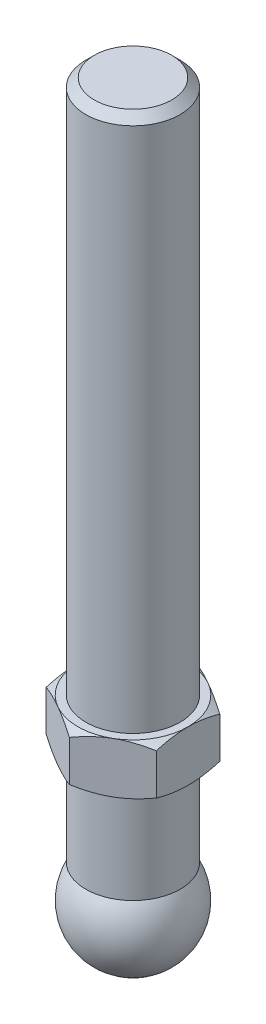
ISO-10303-21;
HEADER;
FILE_DESCRIPTION(('STEP AP214'),'2;1');
FILE_NAME('part.step','',(''),(''),'','','');
FILE_SCHEMA(('AUTOMOTIVE_DESIGN { 1 0 10303 214 1 1 1 1 }'));
ENDSEC;
DATA;
#1=APPLICATION_CONTEXT('core data for automotive mechanical design processes');
#2=APPLICATION_PROTOCOL_DEFINITION('international standard','automotive_design',2000,#1);
#3=PRODUCT_CONTEXT('',#1,'mechanical');
#4=PRODUCT('Part','Part','',(#3));
#5=PRODUCT_RELATED_PRODUCT_CATEGORY('part','',(#4));
#6=PRODUCT_DEFINITION_FORMATION('','',#4);
#7=PRODUCT_DEFINITION_CONTEXT('part definition',#1,'design');
#8=PRODUCT_DEFINITION('design','',#6,#7);
#9=PRODUCT_DEFINITION_SHAPE('','',#8);
#10=(LENGTH_UNIT() NAMED_UNIT(*) SI_UNIT(.MILLI.,.METRE.));
#11=(NAMED_UNIT(*) PLANE_ANGLE_UNIT() SI_UNIT($,.RADIAN.));
#12=(NAMED_UNIT(*) SI_UNIT($,.STERADIAN.) SOLID_ANGLE_UNIT());
#13=UNCERTAINTY_MEASURE_WITH_UNIT(LENGTH_MEASURE(1.E-05),#10,'distance_accuracy_value','');
#14=(GEOMETRIC_REPRESENTATION_CONTEXT(3) GLOBAL_UNCERTAINTY_ASSIGNED_CONTEXT((#13)) GLOBAL_UNIT_ASSIGNED_CONTEXT((#10,
#11,#12)) REPRESENTATION_CONTEXT('',''));
#15=CARTESIAN_POINT('',(0.,0.,0.));
#16=DIRECTION('',(0.,0.,1.));
#17=DIRECTION('',(1.,0.,0.));
#18=AXIS2_PLACEMENT_3D('',#15,#16,#17);
#19=CARTESIAN_POINT('',(0.,22.6,0.));
#20=DIRECTION('',(0.,-1.,0.));
#21=DIRECTION('',(0.,0.,-1.));
#22=AXIS2_PLACEMENT_3D('',#19,#20,#21);
#23=CONICAL_SURFACE('',#22,7.,1.0471975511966);
#24=CARTESIAN_POINT('',(-7.,18.5382826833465,12.1648696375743));
#25=CARTESIAN_POINT('',(-7.,18.683915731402,11.8738003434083));
#26=CARTESIAN_POINT('',(-7.,18.82854589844,11.5822239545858));
#27=CARTESIAN_POINT('',(-7.,19.1153156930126,10.997825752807));
#28=CARTESIAN_POINT('',(-7.,19.2574551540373,10.7050038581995));
#29=CARTESIAN_POINT('',(-7.,19.5390221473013,10.1173316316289));
#30=CARTESIAN_POINT('',(-7.,19.6784436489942,9.82247840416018));
#31=CARTESIAN_POINT('',(-7.,19.9536060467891,9.2310632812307));
#32=CARTESIAN_POINT('',(-7.,20.0893470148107,8.93450141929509));
#33=CARTESIAN_POINT('',(-7.,20.3623110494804,8.32593520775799));
#34=CARTESIAN_POINT('',(-7.,20.4993254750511,8.01383696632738));
#35=CARTESIAN_POINT('',(-7.,20.7671383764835,7.3869579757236));
#36=CARTESIAN_POINT('',(-7.,20.8979365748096,7.07217710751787));
#37=CARTESIAN_POINT('',(-7.,21.1515530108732,6.43962449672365));
#38=CARTESIAN_POINT('',(-7.,21.274376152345,6.12185473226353));
#39=CARTESIAN_POINT('',(-7.,21.5099016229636,5.48260317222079));
#40=CARTESIAN_POINT('',(-7.,21.6226050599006,5.16112178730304));
#41=CARTESIAN_POINT('',(-7.,21.8599014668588,4.43821731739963));
#42=CARTESIAN_POINT('',(-7.,21.981118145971,4.03566892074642));
#43=CARTESIAN_POINT('',(-7.,22.1969740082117,3.22331060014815));
#44=CARTESIAN_POINT('',(-7.,22.2916155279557,2.81350131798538));
#45=CARTESIAN_POINT('',(-7.,22.4069999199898,2.19742561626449));
#46=CARTESIAN_POINT('',(-7.,22.4408518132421,1.99359214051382));
#47=CARTESIAN_POINT('',(-7.,22.4993191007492,1.5846161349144));
#48=CARTESIAN_POINT('',(-7.,22.5239358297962,1.37947379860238));
#49=CARTESIAN_POINT('',(-7.,22.5631968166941,0.968289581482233));
#50=CARTESIAN_POINT('',(-7.,22.5778439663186,0.762247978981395));
#51=CARTESIAN_POINT('',(-7.,22.5967021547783,0.349683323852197));
#52=CARTESIAN_POINT('',(-7.,22.6009132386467,0.143160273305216));
#53=CARTESIAN_POINT('',(-7.,22.5987493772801,-0.271082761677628));
#54=CARTESIAN_POINT('',(-7.,22.5923100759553,-0.478802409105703));
#55=CARTESIAN_POINT('',(-7.,22.5689433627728,-0.893645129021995));
#56=CARTESIAN_POINT('',(-7.,22.5520159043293,-1.10076819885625));
#57=CARTESIAN_POINT('',(-7.,22.5082124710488,-1.51403043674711));
#58=CARTESIAN_POINT('',(-7.,22.4813327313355,-1.72016920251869));
#59=CARTESIAN_POINT('',(-7.,22.4184180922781,-2.13103319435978));
#60=CARTESIAN_POINT('',(-7.,22.3823828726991,-2.33575837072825));
#61=CARTESIAN_POINT('',(-7.,22.2605686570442,-2.95437912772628));
#62=CARTESIAN_POINT('',(-7.,22.1618729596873,-3.36575077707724));
#63=CARTESIAN_POINT('',(-7.,21.9384533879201,-4.1813801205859));
#64=CARTESIAN_POINT('',(-7.,21.8137148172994,-4.58563365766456));
#65=CARTESIAN_POINT('',(-7.,21.5733248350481,-5.30320893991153));
#66=CARTESIAN_POINT('',(-7.,21.4612875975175,-5.6177595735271));
#67=CARTESIAN_POINT('',(-7.,21.2278514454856,-6.24325021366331));
#68=CARTESIAN_POINT('',(-7.,21.1064551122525,-6.55419118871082));
#69=CARTESIAN_POINT('',(-7.,20.8562070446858,-7.17328528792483));
#70=CARTESIAN_POINT('',(-7.,20.7273503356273,-7.48143638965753));
#71=CARTESIAN_POINT('',(-7.,20.4637823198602,-8.09523802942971));
#72=CARTESIAN_POINT('',(-7.,20.3290706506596,-8.40088841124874));
#73=CARTESIAN_POINT('',(-7.,20.0607840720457,-8.99716345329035));
#74=CARTESIAN_POINT('',(-7.,19.9274031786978,-9.2878756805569));
#75=CARTESIAN_POINT('',(-7.,19.6571471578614,-9.86766295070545));
#76=CARTESIAN_POINT('',(-7.,19.52027208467,-10.1567380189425));
#77=CARTESIAN_POINT('',(-7.,19.2438978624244,-10.7329937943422));
#78=CARTESIAN_POINT('',(-7.,19.1044038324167,-11.0201769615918));
#79=CARTESIAN_POINT('',(-7.,18.8230228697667,-11.5933594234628));
#80=CARTESIAN_POINT('',(-7.,18.6811360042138,-11.879358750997));
#81=CARTESIAN_POINT('',(-7.,18.5382826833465,-12.1648696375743));
#82=B_SPLINE_CURVE_WITH_KNOTS('',3,(#24,#25,#26,#27,#28,#29,#30,#31,#32,#33,#34,#35,#36,#37,#38,
#39,#40,#41,#42,#43,#44,#45,#46,#47,#48,#49,#50,#51,#52,#53,#54,#55,#56,#57,#58,#59,#60,#61,#62,
#63,#64,#65,#66,#67,#68,#69,#70,#71,#72,#73,#74,#75,#76,#77,#78,#79,#80,#81),.UNSPECIFIED.,.F.,
.F.,(4,2,2,2,2,2,2,2,2,2,2,2,2,2,2,2,2,2,2,2,2,2,2,2,2,2,2,2,4),(0.,0.976413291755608,
1.95289161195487,2.93133423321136,3.90975772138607,4.93225217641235,5.95479223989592,
6.97669748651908,7.99849072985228,9.25906449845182,10.5195273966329,11.1392271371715,
11.7588372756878,12.3782676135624,12.9976952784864,13.6208795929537,14.2440666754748,
14.8674897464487,15.490934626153,16.7587972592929,18.027377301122,19.0289263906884,
20.0302002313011,21.0321496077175,22.0341611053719,22.9936838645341,23.9531917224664,
24.9109871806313,25.8687558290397),.UNSPECIFIED.);
#83=CARTESIAN_POINT('',(-7.,21.9747852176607,4.04145188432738));
#84=VERTEX_POINT('',#83);
#85=CARTESIAN_POINT('',(-7.,22.6,0.));
#86=VERTEX_POINT('',#85);
#87=EDGE_CURVE('E313',#84,#86,#82,.T.);
#88=ORIENTED_EDGE('',*,*,#87,.F.);
#89=CARTESIAN_POINT('',(0.0002,21.9747185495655,8.0830192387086));
#90=CARTESIAN_POINT('',(-0.153667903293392,22.0260001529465,7.99418356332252));
#91=CARTESIAN_POINT('',(-0.30810950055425,22.0749544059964,7.90501666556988));
#92=CARTESIAN_POINT('',(-0.618246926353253,22.1675672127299,7.72595873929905));
#93=CARTESIAN_POINT('',(-0.773943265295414,22.2112234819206,7.63606741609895));
#94=CARTESIAN_POINT('',(-1.24352516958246,22.3333884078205,7.36495417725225));
#95=CARTESIAN_POINT('',(-1.5592643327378,22.402874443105,7.18266208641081));
#96=CARTESIAN_POINT('',(-2.03176224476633,22.4843550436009,6.9098652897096));
#97=CARTESIAN_POINT('',(-2.18710922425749,22.5075665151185,6.82017566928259));
#98=CARTESIAN_POINT('',(-2.49850511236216,22.5464887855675,6.64039116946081));
#99=CARTESIAN_POINT('',(-2.65455395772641,22.5622002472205,6.55029632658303));
#100=CARTESIAN_POINT('',(-2.96692267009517,22.5857220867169,6.36995016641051));
#101=CARTESIAN_POINT('',(-3.12324202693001,22.5935414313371,6.27969914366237));
#102=CARTESIAN_POINT('',(-3.43601650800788,22.6011197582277,6.09911871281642));
#103=CARTESIAN_POINT('',(-3.59247162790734,22.600878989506,6.00878930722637));
#104=CARTESIAN_POINT('',(-4.02110687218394,22.5891402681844,5.76131663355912));
#105=CARTESIAN_POINT('',(-4.2931466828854,22.5694342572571,5.60425437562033));
#106=CARTESIAN_POINT('',(-4.8354194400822,22.5069465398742,5.29117305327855));
#107=CARTESIAN_POINT('',(-5.10565047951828,22.464143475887,5.13515508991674));
#108=CARTESIAN_POINT('',(-5.64901454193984,22.3571483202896,4.82144370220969));
#109=CARTESIAN_POINT('',(-5.92207900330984,22.2925029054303,4.66378986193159));
#110=CARTESIAN_POINT('',(-6.46413578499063,22.145783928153,4.35083323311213));
#111=CARTESIAN_POINT('',(-6.73313504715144,22.0637448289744,4.19552643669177));
#112=CARTESIAN_POINT('',(-7.0002,21.9747185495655,4.04133641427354));
#113=B_SPLINE_CURVE_WITH_KNOTS('',3,(#89,#90,#91,#92,#93,#94,#95,#96,#97,#98,#99,#100,#101,#102,
#103,#104,#105,#106,#107,#108,#109,#110,#111,#112),.UNSPECIFIED.,.F.,.F.,(4,2,2,2,2,2,2,2,2,2,2,
4),(0.,0.554727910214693,1.10969417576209,2.2219327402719,2.76443041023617,3.30688013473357,
3.8487128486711,4.39052882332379,5.33376515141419,6.27787517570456,7.2429241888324,
8.20607866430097),.UNSPECIFIED.);
#114=CARTESIAN_POINT('',(-3.5,22.6,6.06217782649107));
#115=VERTEX_POINT('',#114);
#116=EDGE_CURVE('E135',#115,#84,#113,.T.);
#117=ORIENTED_EDGE('',*,*,#116,.F.);
#118=CARTESIAN_POINT('',(0.,22.6,0.));
#119=DIRECTION('',(0.,-1.,0.));
#120=DIRECTION('',(0.,0.,-1.));
#121=AXIS2_PLACEMENT_3D('',#118,#119,#120);
#122=CIRCLE('',#121,7.);
#123=EDGE_CURVE('E283',#115,#86,#122,.T.);
#124=ORIENTED_EDGE('',*,*,#123,.T.);
#125=EDGE_LOOP('',(#88,#117,#124));
#126=FACE_BOUND('',#125,.T.);
#127=ADVANCED_FACE('F14',(#126),#23,.T.);
#128=CARTESIAN_POINT('',(-7.,21.9747852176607,-4.04145188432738));
#129=VERTEX_POINT('',#128);
#130=EDGE_CURVE('E193',#86,#129,#82,.T.);
#131=ORIENTED_EDGE('',*,*,#130,.F.);
#132=CARTESIAN_POINT('',(-3.5,22.6,-6.06217782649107));
#133=VERTEX_POINT('',#132);
#134=EDGE_CURVE('E195',#86,#133,#122,.T.);
#135=ORIENTED_EDGE('',*,*,#134,.T.);
#136=CARTESIAN_POINT('',(-7.0002,21.9747185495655,-4.04133641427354));
#137=CARTESIAN_POINT('',(-6.84633209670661,22.0260001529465,-4.13017208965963));
#138=CARTESIAN_POINT('',(-6.69189049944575,22.0749544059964,-4.21933898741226));
#139=CARTESIAN_POINT('',(-6.38175307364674,22.1675672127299,-4.39839691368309));
#140=CARTESIAN_POINT('',(-6.22605673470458,22.2112234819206,-4.48828823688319));
#141=CARTESIAN_POINT('',(-5.75647483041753,22.3333884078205,-4.75940147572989));
#142=CARTESIAN_POINT('',(-5.4407356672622,22.402874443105,-4.94169356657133));
#143=CARTESIAN_POINT('',(-4.96823775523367,22.4843550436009,-5.21449036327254));
#144=CARTESIAN_POINT('',(-4.81289077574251,22.5075665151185,-5.30417998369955));
#145=CARTESIAN_POINT('',(-4.50149488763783,22.5464887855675,-5.48396448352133));
#146=CARTESIAN_POINT('',(-4.34544604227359,22.5622002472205,-5.57405932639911));
#147=CARTESIAN_POINT('',(-4.03307732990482,22.5857220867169,-5.75440548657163));
#148=CARTESIAN_POINT('',(-3.87675797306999,22.5935414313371,-5.84465650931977));
#149=CARTESIAN_POINT('',(-3.56398349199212,22.6011197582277,-6.02523694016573));
#150=CARTESIAN_POINT('',(-3.40752837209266,22.600878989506,-6.11556634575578));
#151=CARTESIAN_POINT('',(-2.97889312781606,22.5891402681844,-6.36303901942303));
#152=CARTESIAN_POINT('',(-2.7068533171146,22.5694342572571,-6.52010127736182));
#153=CARTESIAN_POINT('',(-2.1645805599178,22.5069465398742,-6.83318259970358));
#154=CARTESIAN_POINT('',(-1.89434952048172,22.464143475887,-6.9892005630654));
#155=CARTESIAN_POINT('',(-1.35098545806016,22.3571483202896,-7.30291195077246));
#156=CARTESIAN_POINT('',(-1.07792099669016,22.2925029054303,-7.46056579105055));
#157=CARTESIAN_POINT('',(-0.53586421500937,22.145783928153,-7.77352241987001));
#158=CARTESIAN_POINT('',(-0.266864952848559,22.0637448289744,-7.92882921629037));
#159=CARTESIAN_POINT('',(0.000200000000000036,21.9747185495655,-8.0830192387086));
#160=B_SPLINE_CURVE_WITH_KNOTS('',3,(#136,#137,#138,#139,#140,#141,#142,#143,#144,#145,#146,
#147,#148,#149,#150,#151,#152,#153,#154,#155,#156,#157,#158,#159),.UNSPECIFIED.,.F.,.F.,(4,2,2,
2,2,2,2,2,2,2,2,4),(0.,0.554727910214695,1.10969417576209,2.2219327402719,2.76443041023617,
3.30688013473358,3.8487128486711,4.39052882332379,5.33376515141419,6.27787517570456,
7.2429241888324,8.20607866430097),.UNSPECIFIED.);
#161=EDGE_CURVE('E183',#129,#133,#160,.T.);
#162=ORIENTED_EDGE('',*,*,#161,.F.);
#163=EDGE_LOOP('',(#131,#135,#162));
#164=FACE_BOUND('',#163,.T.);
#165=ADVANCED_FACE('F192',(#164),#23,.T.);
#166=CARTESIAN_POINT('',(0.,21.9747852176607,-8.08290376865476));
#167=VERTEX_POINT('',#166);
#168=EDGE_CURVE('E197',#133,#167,#160,.T.);
#169=ORIENTED_EDGE('',*,*,#168,.F.);
#170=CARTESIAN_POINT('',(3.5,22.6,-6.06217782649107));
#171=VERTEX_POINT('',#170);
#172=EDGE_CURVE('E293',#133,#171,#122,.T.);
#173=ORIENTED_EDGE('',*,*,#172,.T.);
#174=CARTESIAN_POINT('',(-0.0002,21.9747185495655,-8.0830192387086));
#175=CARTESIAN_POINT('',(0.153667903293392,22.0260001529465,-7.99418356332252));
#176=CARTESIAN_POINT('',(0.30810950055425,22.0749544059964,-7.90501666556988));
#177=CARTESIAN_POINT('',(0.618246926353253,22.1675672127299,-7.72595873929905));
#178=CARTESIAN_POINT('',(0.773943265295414,22.2112234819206,-7.63606741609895));
#179=CARTESIAN_POINT('',(1.24352516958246,22.3333884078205,-7.36495417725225));
#180=CARTESIAN_POINT('',(1.5592643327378,22.402874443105,-7.18266208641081));
#181=CARTESIAN_POINT('',(2.03176224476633,22.4843550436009,-6.9098652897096));
#182=CARTESIAN_POINT('',(2.18710922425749,22.5075665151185,-6.82017566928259));
#183=CARTESIAN_POINT('',(2.49850511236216,22.5464887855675,-6.64039116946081));
#184=CARTESIAN_POINT('',(2.65455395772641,22.5622002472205,-6.55029632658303));
#185=CARTESIAN_POINT('',(2.96692267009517,22.5857220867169,-6.36995016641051));
#186=CARTESIAN_POINT('',(3.12324202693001,22.5935414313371,-6.27969914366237));
#187=CARTESIAN_POINT('',(3.43601650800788,22.6011197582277,-6.09911871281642));
#188=CARTESIAN_POINT('',(3.59247162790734,22.600878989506,-6.00878930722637));
#189=CARTESIAN_POINT('',(4.02110687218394,22.5891402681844,-5.76131663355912));
#190=CARTESIAN_POINT('',(4.2931466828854,22.5694342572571,-5.60425437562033));
#191=CARTESIAN_POINT('',(4.8354194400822,22.5069465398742,-5.29117305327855));
#192=CARTESIAN_POINT('',(5.10565047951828,22.464143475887,-5.13515508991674));
#193=CARTESIAN_POINT('',(5.64901454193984,22.3571483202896,-4.82144370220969));
#194=CARTESIAN_POINT('',(5.92207900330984,22.2925029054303,-4.66378986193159));
#195=CARTESIAN_POINT('',(6.46413578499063,22.145783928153,-4.35083323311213));
#196=CARTESIAN_POINT('',(6.73313504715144,22.0637448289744,-4.19552643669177));
#197=CARTESIAN_POINT('',(7.0002,21.9747185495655,-4.04133641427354));
#198=B_SPLINE_CURVE_WITH_KNOTS('',3,(#174,#175,#176,#177,#178,#179,#180,#181,#182,#183,#184,
#185,#186,#187,#188,#189,#190,#191,#192,#193,#194,#195,#196,#197),.UNSPECIFIED.,.F.,.F.,(4,2,2,
2,2,2,2,2,2,2,2,4),(0.,0.554727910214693,1.10969417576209,2.2219327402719,2.76443041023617,
3.30688013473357,3.8487128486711,4.39052882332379,5.33376515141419,6.27787517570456,
7.2429241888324,8.20607866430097),.UNSPECIFIED.);
#199=EDGE_CURVE('E243',#167,#171,#198,.T.);
#200=ORIENTED_EDGE('',*,*,#199,.F.);
#201=EDGE_LOOP('',(#169,#173,#200));
#202=FACE_BOUND('',#201,.T.);
#203=ADVANCED_FACE('F346',(#202),#23,.T.);
#204=CARTESIAN_POINT('',(7.,21.9747852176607,-4.04145188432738));
#205=VERTEX_POINT('',#204);
#206=EDGE_CURVE('E238',#171,#205,#198,.T.);
#207=ORIENTED_EDGE('',*,*,#206,.F.);
#208=CARTESIAN_POINT('',(7.,22.6,0.));
#209=VERTEX_POINT('',#208);
#210=EDGE_CURVE('E288',#171,#209,#122,.T.);
#211=ORIENTED_EDGE('',*,*,#210,.T.);
#212=CARTESIAN_POINT('',(7.,18.5382826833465,-12.1648696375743));
#213=CARTESIAN_POINT('',(7.,18.683915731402,-11.8738003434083));
#214=CARTESIAN_POINT('',(7.,18.82854589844,-11.5822239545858));
#215=CARTESIAN_POINT('',(7.,19.1153156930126,-10.997825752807));
#216=CARTESIAN_POINT('',(7.,19.2574551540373,-10.7050038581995));
#217=CARTESIAN_POINT('',(7.,19.5390221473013,-10.1173316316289));
#218=CARTESIAN_POINT('',(7.,19.6784436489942,-9.82247840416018));
#219=CARTESIAN_POINT('',(7.,19.9536060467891,-9.2310632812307));
#220=CARTESIAN_POINT('',(7.,20.0893470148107,-8.93450141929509));
#221=CARTESIAN_POINT('',(7.,20.3623110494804,-8.32593520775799));
#222=CARTESIAN_POINT('',(7.,20.4993254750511,-8.01383696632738));
#223=CARTESIAN_POINT('',(7.,20.7671383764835,-7.3869579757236));
#224=CARTESIAN_POINT('',(7.,20.8979365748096,-7.07217710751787));
#225=CARTESIAN_POINT('',(7.,21.1515530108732,-6.43962449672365));
#226=CARTESIAN_POINT('',(7.,21.274376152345,-6.12185473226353));
#227=CARTESIAN_POINT('',(7.,21.5099016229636,-5.48260317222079));
#228=CARTESIAN_POINT('',(7.,21.6226050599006,-5.16112178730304));
#229=CARTESIAN_POINT('',(7.,21.8599014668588,-4.43821731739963));
#230=CARTESIAN_POINT('',(7.,21.981118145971,-4.03566892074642));
#231=CARTESIAN_POINT('',(7.,22.1969740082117,-3.22331060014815));
#232=CARTESIAN_POINT('',(7.,22.2916155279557,-2.81350131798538));
#233=CARTESIAN_POINT('',(7.,22.4069999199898,-2.19742561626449));
#234=CARTESIAN_POINT('',(7.,22.4408518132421,-1.99359214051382));
#235=CARTESIAN_POINT('',(7.,22.4993191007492,-1.5846161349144));
#236=CARTESIAN_POINT('',(7.,22.5239358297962,-1.37947379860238));
#237=CARTESIAN_POINT('',(7.,22.5631968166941,-0.968289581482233));
#238=CARTESIAN_POINT('',(7.,22.5778439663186,-0.762247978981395));
#239=CARTESIAN_POINT('',(7.,22.5967021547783,-0.349683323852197));
#240=CARTESIAN_POINT('',(7.,22.6009132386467,-0.143160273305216));
#241=CARTESIAN_POINT('',(7.,22.5987493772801,0.271082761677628));
#242=CARTESIAN_POINT('',(7.,22.5923100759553,0.478802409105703));
#243=CARTESIAN_POINT('',(7.,22.5689433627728,0.893645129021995));
#244=CARTESIAN_POINT('',(7.,22.5520159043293,1.10076819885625));
#245=CARTESIAN_POINT('',(7.,22.5082124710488,1.51403043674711));
#246=CARTESIAN_POINT('',(7.,22.4813327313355,1.72016920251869));
#247=CARTESIAN_POINT('',(7.,22.4184180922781,2.13103319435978));
#248=CARTESIAN_POINT('',(7.,22.3823828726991,2.33575837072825));
#249=CARTESIAN_POINT('',(7.,22.2605686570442,2.95437912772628));
#250=CARTESIAN_POINT('',(7.,22.1618729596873,3.36575077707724));
#251=CARTESIAN_POINT('',(7.,21.9384533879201,4.1813801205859));
#252=CARTESIAN_POINT('',(7.,21.8137148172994,4.58563365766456));
#253=CARTESIAN_POINT('',(7.,21.5733248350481,5.30320893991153));
#254=CARTESIAN_POINT('',(7.,21.4612875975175,5.6177595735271));
#255=CARTESIAN_POINT('',(7.,21.2278514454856,6.24325021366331));
#256=CARTESIAN_POINT('',(7.,21.1064551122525,6.55419118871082));
#257=CARTESIAN_POINT('',(7.,20.8562070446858,7.17328528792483));
#258=CARTESIAN_POINT('',(7.,20.7273503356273,7.48143638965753));
#259=CARTESIAN_POINT('',(7.,20.4637823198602,8.09523802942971));
#260=CARTESIAN_POINT('',(7.,20.3290706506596,8.40088841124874));
#261=CARTESIAN_POINT('',(7.,20.0607840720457,8.99716345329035));
#262=CARTESIAN_POINT('',(7.,19.9274031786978,9.2878756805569));
#263=CARTESIAN_POINT('',(7.,19.6571471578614,9.86766295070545));
#264=CARTESIAN_POINT('',(7.,19.52027208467,10.1567380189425));
#265=CARTESIAN_POINT('',(7.,19.2438978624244,10.7329937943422));
#266=CARTESIAN_POINT('',(7.,19.1044038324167,11.0201769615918));
#267=CARTESIAN_POINT('',(7.,18.8230228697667,11.5933594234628));
#268=CARTESIAN_POINT('',(7.,18.6811360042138,11.879358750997));
#269=CARTESIAN_POINT('',(7.,18.5382826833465,12.1648696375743));
#270=B_SPLINE_CURVE_WITH_KNOTS('',3,(#212,#213,#214,#215,#216,#217,#218,#219,#220,#221,#222,
#223,#224,#225,#226,#227,#228,#229,#230,#231,#232,#233,#234,#235,#236,#237,#238,#239,#240,#241,
#242,#243,#244,#245,#246,#247,#248,#249,#250,#251,#252,#253,#254,#255,#256,#257,#258,#259,#260,
#261,#262,#263,#264,#265,#266,#267,#268,#269),.UNSPECIFIED.,.F.,.F.,(4,2,2,2,2,2,2,2,2,2,2,2,2,
2,2,2,2,2,2,2,2,2,2,2,2,2,2,2,4),(0.,0.976413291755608,1.95289161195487,2.93133423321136,
3.90975772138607,4.93225217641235,5.95479223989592,6.97669748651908,7.99849072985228,
9.25906449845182,10.5195273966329,11.1392271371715,11.7588372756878,12.3782676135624,
12.9976952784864,13.6208795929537,14.2440666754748,14.8674897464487,15.490934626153,
16.7587972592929,18.027377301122,19.0289263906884,20.0302002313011,21.0321496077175,
22.0341611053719,22.9936838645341,23.9531917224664,24.9109871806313,25.8687558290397),.UNSPECIFIED.);
#271=EDGE_CURVE('E249',#205,#209,#270,.T.);
#272=ORIENTED_EDGE('',*,*,#271,.F.);
#273=EDGE_LOOP('',(#207,#211,#272));
#274=FACE_BOUND('',#273,.T.);
#275=ADVANCED_FACE('F356',(#274),#23,.T.);
#276=CARTESIAN_POINT('',(7.,21.9747852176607,4.04145188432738));
#277=VERTEX_POINT('',#276);
#278=EDGE_CURVE('E251',#209,#277,#270,.T.);
#279=ORIENTED_EDGE('',*,*,#278,.F.);
#280=CARTESIAN_POINT('',(3.5,22.6,6.06217782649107));
#281=VERTEX_POINT('',#280);
#282=EDGE_CURVE('E281',#209,#281,#122,.T.);
#283=ORIENTED_EDGE('',*,*,#282,.T.);
#284=CARTESIAN_POINT('',(7.0002,21.9747185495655,4.04133641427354));
#285=CARTESIAN_POINT('',(6.84633209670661,22.0260001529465,4.13017208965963));
#286=CARTESIAN_POINT('',(6.69189049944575,22.0749544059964,4.21933898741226));
#287=CARTESIAN_POINT('',(6.38175307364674,22.1675672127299,4.39839691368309));
#288=CARTESIAN_POINT('',(6.22605673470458,22.2112234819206,4.48828823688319));
#289=CARTESIAN_POINT('',(5.75647483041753,22.3333884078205,4.75940147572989));
#290=CARTESIAN_POINT('',(5.4407356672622,22.402874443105,4.94169356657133));
#291=CARTESIAN_POINT('',(4.96823775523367,22.4843550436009,5.21449036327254));
#292=CARTESIAN_POINT('',(4.81289077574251,22.5075665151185,5.30417998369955));
#293=CARTESIAN_POINT('',(4.50149488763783,22.5464887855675,5.48396448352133));
#294=CARTESIAN_POINT('',(4.34544604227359,22.5622002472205,5.57405932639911));
#295=CARTESIAN_POINT('',(4.03307732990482,22.5857220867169,5.75440548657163));
#296=CARTESIAN_POINT('',(3.87675797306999,22.5935414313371,5.84465650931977));
#297=CARTESIAN_POINT('',(3.56398349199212,22.6011197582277,6.02523694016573));
#298=CARTESIAN_POINT('',(3.40752837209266,22.600878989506,6.11556634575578));
#299=CARTESIAN_POINT('',(2.97889312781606,22.5891402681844,6.36303901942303));
#300=CARTESIAN_POINT('',(2.7068533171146,22.5694342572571,6.52010127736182));
#301=CARTESIAN_POINT('',(2.1645805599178,22.5069465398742,6.83318259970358));
#302=CARTESIAN_POINT('',(1.89434952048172,22.464143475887,6.9892005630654));
#303=CARTESIAN_POINT('',(1.35098545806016,22.3571483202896,7.30291195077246));
#304=CARTESIAN_POINT('',(1.07792099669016,22.2925029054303,7.46056579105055));
#305=CARTESIAN_POINT('',(0.53586421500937,22.145783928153,7.77352241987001));
#306=CARTESIAN_POINT('',(0.266864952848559,22.0637448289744,7.92882921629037));
#307=CARTESIAN_POINT('',(-0.000200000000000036,21.9747185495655,8.0830192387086));
#308=B_SPLINE_CURVE_WITH_KNOTS('',3,(#284,#285,#286,#287,#288,#289,#290,#291,#292,#293,#294,
#295,#296,#297,#298,#299,#300,#301,#302,#303,#304,#305,#306,#307),.UNSPECIFIED.,.F.,.F.,(4,2,2,
2,2,2,2,2,2,2,2,4),(0.,0.554727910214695,1.10969417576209,2.2219327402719,2.76443041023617,
3.30688013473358,3.8487128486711,4.39052882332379,5.33376515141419,6.27787517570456,
7.2429241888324,8.20607866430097),.UNSPECIFIED.);
#309=EDGE_CURVE('E126',#277,#281,#308,.T.);
#310=ORIENTED_EDGE('',*,*,#309,.F.);
#311=EDGE_LOOP('',(#279,#283,#310));
#312=FACE_BOUND('',#311,.T.);
#313=ADVANCED_FACE('F285',(#312),#23,.T.);
#314=CARTESIAN_POINT('',(0.,21.9747852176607,8.08290376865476));
#315=VERTEX_POINT('',#314);
#316=EDGE_CURVE('E116',#281,#315,#308,.T.);
#317=ORIENTED_EDGE('',*,*,#316,.F.);
#318=EDGE_CURVE('E274',#281,#115,#122,.T.);
#319=ORIENTED_EDGE('',*,*,#318,.T.);
#320=EDGE_CURVE('E29',#315,#115,#113,.T.);
#321=ORIENTED_EDGE('',*,*,#320,.F.);
#322=EDGE_LOOP('',(#317,#319,#321));
#323=FACE_BOUND('',#322,.T.);
#324=ADVANCED_FACE('F273',(#323),#23,.T.);
#325=CARTESIAN_POINT('',(0.,90.6,0.));
#326=DIRECTION('',(0.,-1.,0.));
#327=DIRECTION('',(0.,0.,-1.));
#328=AXIS2_PLACEMENT_3D('',#325,#326,#327);
#329=PLANE('',#328);
#330=CARTESIAN_POINT('',(0.,90.6,0.));
#331=DIRECTION('',(0.,-1.,0.));
#332=DIRECTION('',(0.,0.,-1.));
#333=AXIS2_PLACEMENT_3D('',#330,#331,#332);
#334=CIRCLE('',#333,4.9265);
#335=CARTESIAN_POINT('',(0.,90.6,-4.9265));
#336=VERTEX_POINT('',#335);
#337=EDGE_CURVE('E22',#336,#336,#334,.T.);
#338=ORIENTED_EDGE('',*,*,#337,.F.);
#339=EDGE_LOOP('',(#338));
#340=FACE_BOUND('',#339,.T.);
#341=ADVANCED_FACE('F16',(#340),#329,.F.);
#342=CARTESIAN_POINT('',(0.,90.6,0.));
#343=DIRECTION('',(0.,-1.,0.));
#344=DIRECTION('',(0.,0.,-1.));
#345=AXIS2_PLACEMENT_3D('',#342,#343,#344);
#346=CONICAL_SURFACE('',#345,4.9265,0.785398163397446);
#347=CARTESIAN_POINT('',(0.,89.5265,0.));
#348=DIRECTION('',(0.,-1.,0.));
#349=DIRECTION('',(0.,0.,-1.));
#350=AXIS2_PLACEMENT_3D('',#347,#348,#349);
#351=CIRCLE('',#350,6.);
#352=CARTESIAN_POINT('',(0.,89.5265,-6.));
#353=VERTEX_POINT('',#352);
#354=EDGE_CURVE('E290',#353,#353,#351,.T.);
#355=ORIENTED_EDGE('',*,*,#354,.F.);
#356=EDGE_LOOP('',(#355));
#357=FACE_BOUND('',#356,.T.);
#358=ORIENTED_EDGE('',*,*,#337,.T.);
#359=EDGE_LOOP('',(#358));
#360=FACE_BOUND('',#359,.T.);
#361=ADVANCED_FACE('F354',(#357,#360),#346,.T.);
#362=CARTESIAN_POINT('',(0.,-7.,0.));
#363=DIRECTION('',(0.,-1.,0.));
#364=DIRECTION('',(0.,0.,-1.));
#365=AXIS2_PLACEMENT_3D('',#362,#363,#364);
#366=CYLINDRICAL_SURFACE('',#365,6.);
#367=CARTESIAN_POINT('',(0.,22.6,0.));
#368=DIRECTION('',(0.,-1.,0.));
#369=DIRECTION('',(0.,0.,-1.));
#370=AXIS2_PLACEMENT_3D('',#367,#368,#369);
#371=CIRCLE('',#370,6.);
#372=CARTESIAN_POINT('',(0.,22.6,-6.));
#373=VERTEX_POINT('',#372);
#374=EDGE_CURVE('E287',#373,#373,#371,.T.);
#375=ORIENTED_EDGE('',*,*,#374,.F.);
#376=EDGE_LOOP('',(#375));
#377=FACE_BOUND('',#376,.T.);
#378=ORIENTED_EDGE('',*,*,#354,.T.);
#379=EDGE_LOOP('',(#378));
#380=FACE_BOUND('',#379,.T.);
#381=ADVANCED_FACE('F439',(#377,#380),#366,.T.);
#382=CARTESIAN_POINT('',(6.,22.6,0.));
#383=DIRECTION('',(0.,-1.,0.));
#384=DIRECTION('',(0.,0.,-1.));
#385=AXIS2_PLACEMENT_3D('',#382,#383,#384);
#386=PLANE('',#385);
#387=ORIENTED_EDGE('',*,*,#282,.F.);
#388=ORIENTED_EDGE('',*,*,#210,.F.);
#389=ORIENTED_EDGE('',*,*,#172,.F.);
#390=ORIENTED_EDGE('',*,*,#134,.F.);
#391=ORIENTED_EDGE('',*,*,#123,.F.);
#392=ORIENTED_EDGE('',*,*,#318,.F.);
#393=EDGE_LOOP('',(#387,#388,#389,#390,#391,#392));
#394=FACE_BOUND('',#393,.T.);
#395=ORIENTED_EDGE('',*,*,#374,.T.);
#396=EDGE_LOOP('',(#395));
#397=FACE_BOUND('',#396,.T.);
#398=ADVANCED_FACE('F278',(#394,#397),#386,.F.);
#399=CARTESIAN_POINT('',(-7.,16.15,-4.04145188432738));
#400=DIRECTION('',(-1.,0.,0.));
#401=DIRECTION('',(0.,0.,1.));
#402=AXIS2_PLACEMENT_3D('',#399,#400,#401);
#403=PLANE('',#402);
#404=ORIENTED_EDGE('',*,*,#87,.T.);
#405=ORIENTED_EDGE('',*,*,#130,.T.);
#406=DIRECTION('',(0.,1.,0.));
#407=VECTOR('',#406,1.);
#408=CARTESIAN_POINT('',(-7.,16.15,-4.04145188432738));
#409=LINE('',#408,#407);
#410=CARTESIAN_POINT('',(-7.,16.7752147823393,-4.04145188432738));
#411=VERTEX_POINT('',#410);
#412=EDGE_CURVE('E109',#411,#129,#409,.T.);
#413=ORIENTED_EDGE('',*,*,#412,.F.);
#414=CARTESIAN_POINT('',(-7.,20.2117173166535,-12.1648696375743));
#415=CARTESIAN_POINT('',(-7.,20.066084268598,-11.8738003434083));
#416=CARTESIAN_POINT('',(-7.,19.9214541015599,-11.5822239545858));
#417=CARTESIAN_POINT('',(-7.,19.6346843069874,-10.997825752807));
#418=CARTESIAN_POINT('',(-7.,19.4925448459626,-10.7050038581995));
#419=CARTESIAN_POINT('',(-7.,19.2109778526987,-10.117331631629));
#420=CARTESIAN_POINT('',(-7.,19.0715563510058,-9.82247840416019));
#421=CARTESIAN_POINT('',(-7.,18.7963939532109,-9.23106328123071));
#422=CARTESIAN_POINT('',(-7.,18.6606529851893,-8.9345014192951));
#423=CARTESIAN_POINT('',(-7.,18.3876889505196,-8.325935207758));
#424=CARTESIAN_POINT('',(-7.,18.2506745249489,-8.0138369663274));
#425=CARTESIAN_POINT('',(-7.,17.9828616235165,-7.38695797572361));
#426=CARTESIAN_POINT('',(-7.,17.8520634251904,-7.07217710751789));
#427=CARTESIAN_POINT('',(-7.,17.5984469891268,-6.43962449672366));
#428=CARTESIAN_POINT('',(-7.,17.475623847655,-6.12185473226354));
#429=CARTESIAN_POINT('',(-7.,17.2400983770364,-5.4826031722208));
#430=CARTESIAN_POINT('',(-7.,17.1273949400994,-5.16112178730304));
#431=CARTESIAN_POINT('',(-7.,16.8900985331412,-4.43821731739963));
#432=CARTESIAN_POINT('',(-7.,16.768881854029,-4.03566892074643));
#433=CARTESIAN_POINT('',(-7.,16.5530259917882,-3.22331060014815));
#434=CARTESIAN_POINT('',(-7.,16.4583844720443,-2.81350131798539));
#435=CARTESIAN_POINT('',(-7.,16.3430000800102,-2.19742561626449));
#436=CARTESIAN_POINT('',(-7.,16.3091481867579,-1.99359214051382));
#437=CARTESIAN_POINT('',(-7.,16.2506808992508,-1.58461613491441));
#438=CARTESIAN_POINT('',(-7.,16.2260641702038,-1.37947379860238));
#439=CARTESIAN_POINT('',(-7.,16.1868031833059,-0.968289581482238));
#440=CARTESIAN_POINT('',(-7.,16.1721560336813,-0.7622479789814));
#441=CARTESIAN_POINT('',(-7.,16.1532978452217,-0.3496833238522));
#442=CARTESIAN_POINT('',(-7.,16.1490867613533,-0.143160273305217));
#443=CARTESIAN_POINT('',(-7.,16.1512506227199,0.271082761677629));
#444=CARTESIAN_POINT('',(-7.,16.1576899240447,0.478802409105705));
#445=CARTESIAN_POINT('',(-7.,16.1810566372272,0.893645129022));
#446=CARTESIAN_POINT('',(-7.,16.1979840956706,1.10076819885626));
#447=CARTESIAN_POINT('',(-7.,16.2417875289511,1.51403043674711));
#448=CARTESIAN_POINT('',(-7.,16.2686672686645,1.72016920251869));
#449=CARTESIAN_POINT('',(-7.,16.3315819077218,2.13103319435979));
#450=CARTESIAN_POINT('',(-7.,16.3676171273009,2.33575837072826));
#451=CARTESIAN_POINT('',(-7.,16.4894313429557,2.95437912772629));
#452=CARTESIAN_POINT('',(-7.,16.5881270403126,3.36575077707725));
#453=CARTESIAN_POINT('',(-7.,16.8115466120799,4.1813801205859));
#454=CARTESIAN_POINT('',(-7.,16.9362851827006,4.58563365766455));
#455=CARTESIAN_POINT('',(-7.,17.1766751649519,5.30320893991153));
#456=CARTESIAN_POINT('',(-7.,17.2887124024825,5.61775957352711));
#457=CARTESIAN_POINT('',(-7.,17.5221485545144,6.24325021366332));
#458=CARTESIAN_POINT('',(-7.,17.6435448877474,6.55419118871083));
#459=CARTESIAN_POINT('',(-7.,17.8937929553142,7.17328528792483));
#460=CARTESIAN_POINT('',(-7.,18.0226496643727,7.48143638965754));
#461=CARTESIAN_POINT('',(-7.,18.2862176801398,8.09523802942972));
#462=CARTESIAN_POINT('',(-7.,18.4209293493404,8.40088841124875));
#463=CARTESIAN_POINT('',(-7.,18.6892159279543,8.99716345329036));
#464=CARTESIAN_POINT('',(-7.,18.8225968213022,9.28787568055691));
#465=CARTESIAN_POINT('',(-7.,19.0928528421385,9.86766295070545));
#466=CARTESIAN_POINT('',(-7.,19.22972791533,10.1567380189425));
#467=CARTESIAN_POINT('',(-7.,19.5061021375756,10.7329937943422));
#468=CARTESIAN_POINT('',(-7.,19.6455961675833,11.0201769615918));
#469=CARTESIAN_POINT('',(-7.,19.9269771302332,11.5933594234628));
#470=CARTESIAN_POINT('',(-7.,20.0688639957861,11.879358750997));
#471=CARTESIAN_POINT('',(-7.,20.2117173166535,12.1648696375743));
#472=B_SPLINE_CURVE_WITH_KNOTS('',3,(#414,#415,#416,#417,#418,#419,#420,#421,#422,#423,#424,
#425,#426,#427,#428,#429,#430,#431,#432,#433,#434,#435,#436,#437,#438,#439,#440,#441,#442,#443,
#444,#445,#446,#447,#448,#449,#450,#451,#452,#453,#454,#455,#456,#457,#458,#459,#460,#461,#462,
#463,#464,#465,#466,#467,#468,#469,#470,#471),.UNSPECIFIED.,.F.,.F.,(4,2,2,2,2,2,2,2,2,2,2,2,2,
2,2,2,2,2,2,2,2,2,2,2,2,2,2,2,4),(0.,0.97641329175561,1.95289161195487,2.93133423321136,
3.90975772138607,4.93225217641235,5.95479223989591,6.97669748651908,7.99849072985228,
9.25906449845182,10.5195273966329,11.1392271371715,11.7588372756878,12.3782676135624,
12.9976952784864,13.6208795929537,14.2440666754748,14.8674897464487,15.490934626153,
16.758797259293,18.027377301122,19.0289263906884,20.0302002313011,21.0321496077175,
22.0341611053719,22.9936838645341,23.9531917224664,24.9109871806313,25.8687558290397),.UNSPECIFIED.);
#473=CARTESIAN_POINT('',(-7.,16.15,0.));
#474=VERTEX_POINT('',#473);
#475=EDGE_CURVE('E199',#411,#474,#472,.T.);
#476=ORIENTED_EDGE('',*,*,#475,.T.);
#477=CARTESIAN_POINT('',(-7.,16.7752147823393,4.04145188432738));
#478=VERTEX_POINT('',#477);
#479=EDGE_CURVE('E196',#474,#478,#472,.T.);
#480=ORIENTED_EDGE('',*,*,#479,.T.);
#481=DIRECTION('',(0.,1.,0.));
#482=VECTOR('',#481,1.);
#483=CARTESIAN_POINT('',(-7.,16.15,4.04145188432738));
#484=LINE('',#483,#482);
#485=EDGE_CURVE('E118',#478,#84,#484,.T.);
#486=ORIENTED_EDGE('',*,*,#485,.T.);
#487=EDGE_LOOP('',(#404,#405,#413,#476,#480,#486));
#488=FACE_BOUND('',#487,.T.);
#489=ADVANCED_FACE('F224',(#488),#403,.T.);
#490=CARTESIAN_POINT('',(0.,16.15,-8.08290376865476));
#491=DIRECTION('',(-0.5,0.,-0.866025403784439));
#492=DIRECTION('',(-0.866025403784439,0.,0.5));
#493=AXIS2_PLACEMENT_3D('',#490,#491,#492);
#494=PLANE('',#493);
#495=ORIENTED_EDGE('',*,*,#161,.T.);
#496=ORIENTED_EDGE('',*,*,#168,.T.);
#497=DIRECTION('',(0.,1.,0.));
#498=VECTOR('',#497,1.);
#499=CARTESIAN_POINT('',(0.,16.15,-8.08290376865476));
#500=LINE('',#499,#498);
#501=CARTESIAN_POINT('',(0.,16.7752147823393,-8.08290376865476));
#502=VERTEX_POINT('',#501);
#503=EDGE_CURVE('E175',#502,#167,#500,.T.);
#504=ORIENTED_EDGE('',*,*,#503,.F.);
#505=CARTESIAN_POINT('',(0.000200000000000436,16.7752814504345,-8.0830192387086));
#506=CARTESIAN_POINT('',(-0.153667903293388,16.7239998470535,-7.99418356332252));
#507=CARTESIAN_POINT('',(-0.308109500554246,16.6750455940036,-7.90501666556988));
#508=CARTESIAN_POINT('',(-0.61824692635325,16.5824327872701,-7.72595873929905));
#509=CARTESIAN_POINT('',(-0.773943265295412,16.5387765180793,-7.63606741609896));
#510=CARTESIAN_POINT('',(-1.24352516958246,16.4166115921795,-7.36495417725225));
#511=CARTESIAN_POINT('',(-1.5592643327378,16.3471255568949,-7.18266208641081));
#512=CARTESIAN_POINT('',(-2.03176224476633,16.2656449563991,-6.9098652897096));
#513=CARTESIAN_POINT('',(-2.18710922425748,16.2424334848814,-6.82017566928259));
#514=CARTESIAN_POINT('',(-2.49850511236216,16.2035112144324,-6.64039116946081));
#515=CARTESIAN_POINT('',(-2.65455395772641,16.1877997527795,-6.55029632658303));
#516=CARTESIAN_POINT('',(-2.96692267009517,16.164277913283,-6.36995016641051));
#517=CARTESIAN_POINT('',(-3.12324202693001,16.1564585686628,-6.27969914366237));
#518=CARTESIAN_POINT('',(-3.43601650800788,16.1488802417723,-6.09911871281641));
#519=CARTESIAN_POINT('',(-3.59247162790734,16.149121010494,-6.00878930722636));
#520=CARTESIAN_POINT('',(-4.02110687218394,16.1608597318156,-5.7613166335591));
#521=CARTESIAN_POINT('',(-4.29314668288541,16.1805657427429,-5.60425437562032));
#522=CARTESIAN_POINT('',(-4.8354194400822,16.2430534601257,-5.29117305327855));
#523=CARTESIAN_POINT('',(-5.10565047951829,16.285856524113,-5.13515508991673));
#524=CARTESIAN_POINT('',(-5.64901454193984,16.3928516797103,-4.82144370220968));
#525=CARTESIAN_POINT('',(-5.92207900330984,16.4574970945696,-4.66378986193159));
#526=CARTESIAN_POINT('',(-6.46413578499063,16.604216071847,-4.35083323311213));
#527=CARTESIAN_POINT('',(-6.73313504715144,16.6862551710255,-4.19552643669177));
#528=CARTESIAN_POINT('',(-7.0002,16.7752814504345,-4.04133641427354));
#529=B_SPLINE_CURVE_WITH_KNOTS('',3,(#505,#506,#507,#508,#509,#510,#511,#512,#513,#514,#515,
#516,#517,#518,#519,#520,#521,#522,#523,#524,#525,#526,#527,#528),.UNSPECIFIED.,.F.,.F.,(4,2,2,
2,2,2,2,2,2,2,2,4),(0.,0.554727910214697,1.1096941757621,2.2219327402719,2.76443041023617,
3.30688013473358,3.84871284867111,4.3905288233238,5.3337651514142,6.27787517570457,
7.24292418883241,8.20607866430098),.UNSPECIFIED.);
#530=CARTESIAN_POINT('',(-3.5,16.15,-6.06217782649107));
#531=VERTEX_POINT('',#530);
#532=EDGE_CURVE('E201',#502,#531,#529,.T.);
#533=ORIENTED_EDGE('',*,*,#532,.T.);
#534=EDGE_CURVE('E186',#531,#411,#529,.T.);
#535=ORIENTED_EDGE('',*,*,#534,.T.);
#536=ORIENTED_EDGE('',*,*,#412,.T.);
#537=EDGE_LOOP('',(#495,#496,#504,#533,#535,#536));
#538=FACE_BOUND('',#537,.T.);
#539=ADVANCED_FACE('F182',(#538),#494,.T.);
#540=CARTESIAN_POINT('',(7.,16.15,-4.04145188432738));
#541=DIRECTION('',(0.5,0.,-0.866025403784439));
#542=DIRECTION('',(-0.866025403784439,0.,-0.5));
#543=AXIS2_PLACEMENT_3D('',#540,#541,#542);
#544=PLANE('',#543);
#545=ORIENTED_EDGE('',*,*,#199,.T.);
#546=ORIENTED_EDGE('',*,*,#206,.T.);
#547=DIRECTION('',(0.,1.,0.));
#548=VECTOR('',#547,1.);
#549=CARTESIAN_POINT('',(7.,16.15,-4.04145188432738));
#550=LINE('',#549,#548);
#551=CARTESIAN_POINT('',(7.,16.7752147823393,-4.04145188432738));
#552=VERTEX_POINT('',#551);
#553=EDGE_CURVE('E172',#552,#205,#550,.T.);
#554=ORIENTED_EDGE('',*,*,#553,.F.);
#555=CARTESIAN_POINT('',(7.0002,16.7752814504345,-4.04133641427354));
#556=CARTESIAN_POINT('',(6.84633209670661,16.7239998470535,-4.13017208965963));
#557=CARTESIAN_POINT('',(6.69189049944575,16.6750455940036,-4.21933898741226));
#558=CARTESIAN_POINT('',(6.38175307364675,16.5824327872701,-4.39839691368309));
#559=CARTESIAN_POINT('',(6.22605673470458,16.5387765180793,-4.48828823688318));
#560=CARTESIAN_POINT('',(5.75647483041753,16.4166115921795,-4.75940147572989));
#561=CARTESIAN_POINT('',(5.4407356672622,16.3471255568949,-4.94169356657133));
#562=CARTESIAN_POINT('',(4.96823775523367,16.2656449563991,-5.21449036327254));
#563=CARTESIAN_POINT('',(4.81289077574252,16.2424334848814,-5.30417998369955));
#564=CARTESIAN_POINT('',(4.50149488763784,16.2035112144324,-5.48396448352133));
#565=CARTESIAN_POINT('',(4.34544604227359,16.1877997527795,-5.57405932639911));
#566=CARTESIAN_POINT('',(4.03307732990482,16.164277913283,-5.75440548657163));
#567=CARTESIAN_POINT('',(3.87675797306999,16.1564585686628,-5.84465650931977));
#568=CARTESIAN_POINT('',(3.56398349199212,16.1488802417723,-6.02523694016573));
#569=CARTESIAN_POINT('',(3.40752837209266,16.149121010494,-6.11556634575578));
#570=CARTESIAN_POINT('',(2.97889312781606,16.1608597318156,-6.36303901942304));
#571=CARTESIAN_POINT('',(2.7068533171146,16.1805657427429,-6.52010127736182));
#572=CARTESIAN_POINT('',(2.1645805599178,16.2430534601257,-6.83318259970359));
#573=CARTESIAN_POINT('',(1.89434952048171,16.285856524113,-6.9892005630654));
#574=CARTESIAN_POINT('',(1.35098545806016,16.3928516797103,-7.30291195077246));
#575=CARTESIAN_POINT('',(1.07792099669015,16.4574970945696,-7.46056579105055));
#576=CARTESIAN_POINT('',(0.535864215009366,16.604216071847,-7.77352241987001));
#577=CARTESIAN_POINT('',(0.266864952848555,16.6862551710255,-7.92882921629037));
#578=CARTESIAN_POINT('',(-0.000200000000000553,16.7752814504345,-8.0830192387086));
#579=B_SPLINE_CURVE_WITH_KNOTS('',3,(#555,#556,#557,#558,#559,#560,#561,#562,#563,#564,#565,
#566,#567,#568,#569,#570,#571,#572,#573,#574,#575,#576,#577,#578),.UNSPECIFIED.,.F.,.F.,(4,2,2,
2,2,2,2,2,2,2,2,4),(0.,0.554727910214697,1.1096941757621,2.2219327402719,2.76443041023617,
3.30688013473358,3.84871284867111,4.3905288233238,5.3337651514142,6.27787517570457,
7.24292418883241,8.20607866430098),.UNSPECIFIED.);
#580=CARTESIAN_POINT('',(3.5,16.15,-6.06217782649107));
#581=VERTEX_POINT('',#580);
#582=EDGE_CURVE('E244',#552,#581,#579,.T.);
#583=ORIENTED_EDGE('',*,*,#582,.T.);
#584=EDGE_CURVE('E232',#581,#502,#579,.T.);
#585=ORIENTED_EDGE('',*,*,#584,.T.);
#586=ORIENTED_EDGE('',*,*,#503,.T.);
#587=EDGE_LOOP('',(#545,#546,#554,#583,#585,#586));
#588=FACE_BOUND('',#587,.T.);
#589=ADVANCED_FACE('F223',(#588),#544,.T.);
#590=CARTESIAN_POINT('',(7.,16.15,4.04145188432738));
#591=DIRECTION('',(1.,0.,0.));
#592=DIRECTION('',(0.,0.,-1.));
#593=AXIS2_PLACEMENT_3D('',#590,#591,#592);
#594=PLANE('',#593);
#595=ORIENTED_EDGE('',*,*,#271,.T.);
#596=ORIENTED_EDGE('',*,*,#278,.T.);
#597=DIRECTION('',(0.,1.,0.));
#598=VECTOR('',#597,1.);
#599=CARTESIAN_POINT('',(7.,16.15,4.04145188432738));
#600=LINE('',#599,#598);
#601=CARTESIAN_POINT('',(7.,16.7752147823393,4.04145188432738));
#602=VERTEX_POINT('',#601);
#603=EDGE_CURVE('E117',#602,#277,#600,.T.);
#604=ORIENTED_EDGE('',*,*,#603,.F.);
#605=CARTESIAN_POINT('',(7.,20.2117173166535,12.1648696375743));
#606=CARTESIAN_POINT('',(7.,20.066084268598,11.8738003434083));
#607=CARTESIAN_POINT('',(7.,19.9214541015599,11.5822239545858));
#608=CARTESIAN_POINT('',(7.,19.6346843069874,10.997825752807));
#609=CARTESIAN_POINT('',(7.,19.4925448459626,10.7050038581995));
#610=CARTESIAN_POINT('',(7.,19.2109778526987,10.117331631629));
#611=CARTESIAN_POINT('',(7.,19.0715563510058,9.82247840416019));
#612=CARTESIAN_POINT('',(7.,18.7963939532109,9.23106328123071));
#613=CARTESIAN_POINT('',(7.,18.6606529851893,8.9345014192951));
#614=CARTESIAN_POINT('',(7.,18.3876889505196,8.325935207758));
#615=CARTESIAN_POINT('',(7.,18.2506745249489,8.0138369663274));
#616=CARTESIAN_POINT('',(7.,17.9828616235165,7.38695797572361));
#617=CARTESIAN_POINT('',(7.,17.8520634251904,7.07217710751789));
#618=CARTESIAN_POINT('',(7.,17.5984469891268,6.43962449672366));
#619=CARTESIAN_POINT('',(7.,17.475623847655,6.12185473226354));
#620=CARTESIAN_POINT('',(7.,17.2400983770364,5.4826031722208));
#621=CARTESIAN_POINT('',(7.,17.1273949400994,5.16112178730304));
#622=CARTESIAN_POINT('',(7.,16.8900985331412,4.43821731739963));
#623=CARTESIAN_POINT('',(7.,16.768881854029,4.03566892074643));
#624=CARTESIAN_POINT('',(7.,16.5530259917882,3.22331060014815));
#625=CARTESIAN_POINT('',(7.,16.4583844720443,2.81350131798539));
#626=CARTESIAN_POINT('',(7.,16.3430000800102,2.19742561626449));
#627=CARTESIAN_POINT('',(7.,16.3091481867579,1.99359214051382));
#628=CARTESIAN_POINT('',(7.,16.2506808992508,1.58461613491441));
#629=CARTESIAN_POINT('',(7.,16.2260641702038,1.37947379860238));
#630=CARTESIAN_POINT('',(7.,16.1868031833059,0.968289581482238));
#631=CARTESIAN_POINT('',(7.,16.1721560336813,0.7622479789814));
#632=CARTESIAN_POINT('',(7.,16.1532978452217,0.3496833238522));
#633=CARTESIAN_POINT('',(7.,16.1490867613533,0.143160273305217));
#634=CARTESIAN_POINT('',(7.,16.1512506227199,-0.271082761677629));
#635=CARTESIAN_POINT('',(7.,16.1576899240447,-0.478802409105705));
#636=CARTESIAN_POINT('',(7.,16.1810566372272,-0.893645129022));
#637=CARTESIAN_POINT('',(7.,16.1979840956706,-1.10076819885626));
#638=CARTESIAN_POINT('',(7.,16.2417875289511,-1.51403043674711));
#639=CARTESIAN_POINT('',(7.,16.2686672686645,-1.72016920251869));
#640=CARTESIAN_POINT('',(7.,16.3315819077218,-2.13103319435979));
#641=CARTESIAN_POINT('',(7.,16.3676171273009,-2.33575837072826));
#642=CARTESIAN_POINT('',(7.,16.4894313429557,-2.95437912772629));
#643=CARTESIAN_POINT('',(7.,16.5881270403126,-3.36575077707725));
#644=CARTESIAN_POINT('',(7.,16.8115466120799,-4.1813801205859));
#645=CARTESIAN_POINT('',(7.,16.9362851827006,-4.58563365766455));
#646=CARTESIAN_POINT('',(7.,17.1766751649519,-5.30320893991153));
#647=CARTESIAN_POINT('',(7.,17.2887124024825,-5.61775957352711));
#648=CARTESIAN_POINT('',(7.,17.5221485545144,-6.24325021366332));
#649=CARTESIAN_POINT('',(7.,17.6435448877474,-6.55419118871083));
#650=CARTESIAN_POINT('',(7.,17.8937929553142,-7.17328528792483));
#651=CARTESIAN_POINT('',(7.,18.0226496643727,-7.48143638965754));
#652=CARTESIAN_POINT('',(7.,18.2862176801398,-8.09523802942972));
#653=CARTESIAN_POINT('',(7.,18.4209293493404,-8.40088841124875));
#654=CARTESIAN_POINT('',(7.,18.6892159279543,-8.99716345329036));
#655=CARTESIAN_POINT('',(7.,18.8225968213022,-9.28787568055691));
#656=CARTESIAN_POINT('',(7.,19.0928528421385,-9.86766295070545));
#657=CARTESIAN_POINT('',(7.,19.22972791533,-10.1567380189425));
#658=CARTESIAN_POINT('',(7.,19.5061021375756,-10.7329937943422));
#659=CARTESIAN_POINT('',(7.,19.6455961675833,-11.0201769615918));
#660=CARTESIAN_POINT('',(7.,19.9269771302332,-11.5933594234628));
#661=CARTESIAN_POINT('',(7.,20.0688639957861,-11.879358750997));
#662=CARTESIAN_POINT('',(7.,20.2117173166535,-12.1648696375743));
#663=B_SPLINE_CURVE_WITH_KNOTS('',3,(#605,#606,#607,#608,#609,#610,#611,#612,#613,#614,#615,
#616,#617,#618,#619,#620,#621,#622,#623,#624,#625,#626,#627,#628,#629,#630,#631,#632,#633,#634,
#635,#636,#637,#638,#639,#640,#641,#642,#643,#644,#645,#646,#647,#648,#649,#650,#651,#652,#653,
#654,#655,#656,#657,#658,#659,#660,#661,#662),.UNSPECIFIED.,.F.,.F.,(4,2,2,2,2,2,2,2,2,2,2,2,2,
2,2,2,2,2,2,2,2,2,2,2,2,2,2,2,4),(0.,0.97641329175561,1.95289161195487,2.93133423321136,
3.90975772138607,4.93225217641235,5.95479223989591,6.97669748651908,7.99849072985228,
9.25906449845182,10.5195273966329,11.1392271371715,11.7588372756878,12.3782676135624,
12.9976952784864,13.6208795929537,14.2440666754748,14.8674897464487,15.490934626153,
16.758797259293,18.027377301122,19.0289263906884,20.0302002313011,21.0321496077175,
22.0341611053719,22.9936838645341,23.9531917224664,24.9109871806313,25.8687558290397),.UNSPECIFIED.);
#664=CARTESIAN_POINT('',(7.,16.15,0.));
#665=VERTEX_POINT('',#664);
#666=EDGE_CURVE('E255',#602,#665,#663,.T.);
#667=ORIENTED_EDGE('',*,*,#666,.T.);
#668=EDGE_CURVE('E260',#665,#552,#663,.T.);
#669=ORIENTED_EDGE('',*,*,#668,.T.);
#670=ORIENTED_EDGE('',*,*,#553,.T.);
#671=EDGE_LOOP('',(#595,#596,#604,#667,#669,#670));
#672=FACE_BOUND('',#671,.T.);
#673=ADVANCED_FACE('F153',(#672),#594,.T.);
#674=CARTESIAN_POINT('',(0.,16.15,8.08290376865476));
#675=DIRECTION('',(0.5,0.,0.866025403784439));
#676=DIRECTION('',(0.866025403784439,0.,-0.5));
#677=AXIS2_PLACEMENT_3D('',#674,#675,#676);
#678=PLANE('',#677);
#679=ORIENTED_EDGE('',*,*,#309,.T.);
#680=ORIENTED_EDGE('',*,*,#316,.T.);
#681=DIRECTION('',(0.,1.,0.));
#682=VECTOR('',#681,1.);
#683=CARTESIAN_POINT('',(0.,16.15,8.08290376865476));
#684=LINE('',#683,#682);
#685=CARTESIAN_POINT('',(0.,16.7752147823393,8.08290376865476));
#686=VERTEX_POINT('',#685);
#687=EDGE_CURVE('E104',#686,#315,#684,.T.);
#688=ORIENTED_EDGE('',*,*,#687,.F.);
#689=CARTESIAN_POINT('',(-0.000200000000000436,16.7752814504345,8.0830192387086));
#690=CARTESIAN_POINT('',(0.153667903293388,16.7239998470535,7.99418356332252));
#691=CARTESIAN_POINT('',(0.308109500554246,16.6750455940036,7.90501666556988));
#692=CARTESIAN_POINT('',(0.61824692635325,16.5824327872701,7.72595873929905));
#693=CARTESIAN_POINT('',(0.773943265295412,16.5387765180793,7.63606741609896));
#694=CARTESIAN_POINT('',(1.24352516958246,16.4166115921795,7.36495417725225));
#695=CARTESIAN_POINT('',(1.5592643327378,16.3471255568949,7.18266208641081));
#696=CARTESIAN_POINT('',(2.03176224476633,16.2656449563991,6.9098652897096));
#697=CARTESIAN_POINT('',(2.18710922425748,16.2424334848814,6.82017566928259));
#698=CARTESIAN_POINT('',(2.49850511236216,16.2035112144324,6.64039116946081));
#699=CARTESIAN_POINT('',(2.65455395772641,16.1877997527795,6.55029632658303));
#700=CARTESIAN_POINT('',(2.96692267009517,16.164277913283,6.36995016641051));
#701=CARTESIAN_POINT('',(3.12324202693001,16.1564585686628,6.27969914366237));
#702=CARTESIAN_POINT('',(3.43601650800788,16.1488802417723,6.09911871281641));
#703=CARTESIAN_POINT('',(3.59247162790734,16.149121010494,6.00878930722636));
#704=CARTESIAN_POINT('',(4.02110687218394,16.1608597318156,5.7613166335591));
#705=CARTESIAN_POINT('',(4.29314668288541,16.1805657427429,5.60425437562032));
#706=CARTESIAN_POINT('',(4.8354194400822,16.2430534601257,5.29117305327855));
#707=CARTESIAN_POINT('',(5.10565047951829,16.285856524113,5.13515508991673));
#708=CARTESIAN_POINT('',(5.64901454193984,16.3928516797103,4.82144370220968));
#709=CARTESIAN_POINT('',(5.92207900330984,16.4574970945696,4.66378986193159));
#710=CARTESIAN_POINT('',(6.46413578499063,16.604216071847,4.35083323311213));
#711=CARTESIAN_POINT('',(6.73313504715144,16.6862551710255,4.19552643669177));
#712=CARTESIAN_POINT('',(7.0002,16.7752814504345,4.04133641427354));
#713=B_SPLINE_CURVE_WITH_KNOTS('',3,(#689,#690,#691,#692,#693,#694,#695,#696,#697,#698,#699,
#700,#701,#702,#703,#704,#705,#706,#707,#708,#709,#710,#711,#712),.UNSPECIFIED.,.F.,.F.,(4,2,2,
2,2,2,2,2,2,2,2,4),(0.,0.554727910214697,1.1096941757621,2.2219327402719,2.76443041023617,
3.30688013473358,3.84871284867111,4.3905288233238,5.3337651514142,6.27787517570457,
7.24292418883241,8.20607866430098),.UNSPECIFIED.);
#714=CARTESIAN_POINT('',(3.5,16.15,6.06217782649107));
#715=VERTEX_POINT('',#714);
#716=EDGE_CURVE('E113',#686,#715,#713,.T.);
#717=ORIENTED_EDGE('',*,*,#716,.T.);
#718=EDGE_CURVE('E124',#715,#602,#713,.T.);
#719=ORIENTED_EDGE('',*,*,#718,.T.);
#720=ORIENTED_EDGE('',*,*,#603,.T.);
#721=EDGE_LOOP('',(#679,#680,#688,#717,#719,#720));
#722=FACE_BOUND('',#721,.T.);
#723=ADVANCED_FACE('F112',(#722),#678,.T.);
#724=CARTESIAN_POINT('',(-7.,16.15,4.04145188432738));
#725=DIRECTION('',(-0.5,0.,0.866025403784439));
#726=DIRECTION('',(0.866025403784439,0.,0.5));
#727=AXIS2_PLACEMENT_3D('',#724,#725,#726);
#728=PLANE('',#727);
#729=ORIENTED_EDGE('',*,*,#320,.T.);
#730=ORIENTED_EDGE('',*,*,#116,.T.);
#731=ORIENTED_EDGE('',*,*,#485,.F.);
#732=CARTESIAN_POINT('',(-7.0002,16.7752814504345,4.04133641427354));
#733=CARTESIAN_POINT('',(-6.84633209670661,16.7239998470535,4.13017208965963));
#734=CARTESIAN_POINT('',(-6.69189049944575,16.6750455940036,4.21933898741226));
#735=CARTESIAN_POINT('',(-6.38175307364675,16.5824327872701,4.39839691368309));
#736=CARTESIAN_POINT('',(-6.22605673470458,16.5387765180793,4.48828823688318));
#737=CARTESIAN_POINT('',(-5.75647483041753,16.4166115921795,4.75940147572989));
#738=CARTESIAN_POINT('',(-5.4407356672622,16.3471255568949,4.94169356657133));
#739=CARTESIAN_POINT('',(-4.96823775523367,16.2656449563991,5.21449036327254));
#740=CARTESIAN_POINT('',(-4.81289077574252,16.2424334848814,5.30417998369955));
#741=CARTESIAN_POINT('',(-4.50149488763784,16.2035112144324,5.48396448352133));
#742=CARTESIAN_POINT('',(-4.34544604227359,16.1877997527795,5.57405932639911));
#743=CARTESIAN_POINT('',(-4.03307732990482,16.164277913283,5.75440548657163));
#744=CARTESIAN_POINT('',(-3.87675797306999,16.1564585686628,5.84465650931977));
#745=CARTESIAN_POINT('',(-3.56398349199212,16.1488802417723,6.02523694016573));
#746=CARTESIAN_POINT('',(-3.40752837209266,16.149121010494,6.11556634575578));
#747=CARTESIAN_POINT('',(-2.97889312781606,16.1608597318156,6.36303901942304));
#748=CARTESIAN_POINT('',(-2.7068533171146,16.1805657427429,6.52010127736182));
#749=CARTESIAN_POINT('',(-2.1645805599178,16.2430534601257,6.83318259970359));
#750=CARTESIAN_POINT('',(-1.89434952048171,16.285856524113,6.9892005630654));
#751=CARTESIAN_POINT('',(-1.35098545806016,16.3928516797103,7.30291195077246));
#752=CARTESIAN_POINT('',(-1.07792099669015,16.4574970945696,7.46056579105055));
#753=CARTESIAN_POINT('',(-0.535864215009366,16.604216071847,7.77352241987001));
#754=CARTESIAN_POINT('',(-0.266864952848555,16.6862551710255,7.92882921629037));
#755=CARTESIAN_POINT('',(0.000200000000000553,16.7752814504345,8.0830192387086));
#756=B_SPLINE_CURVE_WITH_KNOTS('',3,(#732,#733,#734,#735,#736,#737,#738,#739,#740,#741,#742,
#743,#744,#745,#746,#747,#748,#749,#750,#751,#752,#753,#754,#755),.UNSPECIFIED.,.F.,.F.,(4,2,2,
2,2,2,2,2,2,2,2,4),(0.,0.554727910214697,1.1096941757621,2.2219327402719,2.76443041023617,
3.30688013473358,3.84871284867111,4.3905288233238,5.3337651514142,6.27787517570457,
7.24292418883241,8.20607866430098),.UNSPECIFIED.);
#757=CARTESIAN_POINT('',(-3.5,16.15,6.06217782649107));
#758=VERTEX_POINT('',#757);
#759=EDGE_CURVE('E36',#478,#758,#756,.T.);
#760=ORIENTED_EDGE('',*,*,#759,.T.);
#761=EDGE_CURVE('E101',#758,#686,#756,.T.);
#762=ORIENTED_EDGE('',*,*,#761,.T.);
#763=ORIENTED_EDGE('',*,*,#687,.T.);
#764=EDGE_LOOP('',(#729,#730,#731,#760,#762,#763));
#765=FACE_BOUND('',#764,.T.);
#766=ADVANCED_FACE('F103',(#765),#728,.T.);
#767=CARTESIAN_POINT('',(0.,0.,0.));
#768=DIRECTION('',(0.,-1.,0.));
#769=DIRECTION('',(-1.,0.,0.));
#770=AXIS2_PLACEMENT_3D('',#767,#768,#769);
#771=SPHERICAL_SURFACE('',#770,7.);
#772=CARTESIAN_POINT('',(0.,4.2,0.));
#773=DIRECTION('',(0.,1.,0.));
#774=DIRECTION('',(0.,0.,1.));
#775=AXIS2_PLACEMENT_3D('',#772,#773,#774);
#776=CIRCLE('',#775,5.6);
#777=CARTESIAN_POINT('',(0.,4.2,5.6));
#778=VERTEX_POINT('',#777);
#779=EDGE_CURVE('E9',#778,#778,#776,.T.);
#780=ORIENTED_EDGE('',*,*,#779,.F.);
#781=EDGE_LOOP('',(#780));
#782=FACE_BOUND('',#781,.T.);
#783=ADVANCED_FACE('F160',(#782),#771,.T.);
#784=CARTESIAN_POINT('',(6.,4.2,0.));
#785=DIRECTION('',(0.,1.,0.));
#786=DIRECTION('',(0.,0.,1.));
#787=AXIS2_PLACEMENT_3D('',#784,#785,#786);
#788=PLANE('',#787);
#789=ORIENTED_EDGE('',*,*,#779,.T.);
#790=EDGE_LOOP('',(#789));
#791=FACE_BOUND('',#790,.T.);
#792=CARTESIAN_POINT('',(0.,4.2,0.));
#793=DIRECTION('',(0.,-1.,0.));
#794=DIRECTION('',(0.,0.,-1.));
#795=AXIS2_PLACEMENT_3D('',#792,#793,#794);
#796=CIRCLE('',#795,6.);
#797=CARTESIAN_POINT('',(0.,4.2,-6.));
#798=VERTEX_POINT('',#797);
#799=EDGE_CURVE('E309',#798,#798,#796,.T.);
#800=ORIENTED_EDGE('',*,*,#799,.T.);
#801=EDGE_LOOP('',(#800));
#802=FACE_BOUND('',#801,.T.);
#803=ADVANCED_FACE('F379',(#791,#802),#788,.F.);
#804=CARTESIAN_POINT('',(0.,-7.,0.));
#805=DIRECTION('',(0.,-1.,0.));
#806=DIRECTION('',(0.,0.,-1.));
#807=AXIS2_PLACEMENT_3D('',#804,#805,#806);
#808=CYLINDRICAL_SURFACE('',#807,6.);
#809=ORIENTED_EDGE('',*,*,#799,.F.);
#810=EDGE_LOOP('',(#809));
#811=FACE_BOUND('',#810,.T.);
#812=CARTESIAN_POINT('',(0.,16.15,0.));
#813=DIRECTION('',(0.,-1.,0.));
#814=DIRECTION('',(0.,0.,-1.));
#815=AXIS2_PLACEMENT_3D('',#812,#813,#814);
#816=CIRCLE('',#815,6.);
#817=CARTESIAN_POINT('',(0.,16.15,-6.));
#818=VERTEX_POINT('',#817);
#819=EDGE_CURVE('E304',#818,#818,#816,.T.);
#820=ORIENTED_EDGE('',*,*,#819,.T.);
#821=EDGE_LOOP('',(#820));
#822=FACE_BOUND('',#821,.T.);
#823=ADVANCED_FACE('F373',(#811,#822),#808,.T.);
#824=CARTESIAN_POINT('',(0.,16.9582903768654,0.));
#825=DIRECTION('',(0.,1.,0.));
#826=DIRECTION('',(0.,0.,1.));
#827=AXIS2_PLACEMENT_3D('',#824,#825,#826);
#828=CONICAL_SURFACE('',#827,8.4,1.0471975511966);
#829=ORIENTED_EDGE('',*,*,#582,.F.);
#830=ORIENTED_EDGE('',*,*,#668,.F.);
#831=CARTESIAN_POINT('',(0.,16.15,0.));
#832=DIRECTION('',(0.,-1.,0.));
#833=DIRECTION('',(0.,0.,-1.));
#834=AXIS2_PLACEMENT_3D('',#831,#832,#833);
#835=CIRCLE('',#834,7.);
#836=EDGE_CURVE('E297',#581,#665,#835,.T.);
#837=ORIENTED_EDGE('',*,*,#836,.F.);
#838=EDGE_LOOP('',(#829,#830,#837));
#839=FACE_BOUND('',#838,.T.);
#840=ADVANCED_FACE('F147',(#839),#828,.T.);
#841=ORIENTED_EDGE('',*,*,#584,.F.);
#842=EDGE_CURVE('E303',#531,#581,#835,.T.);
#843=ORIENTED_EDGE('',*,*,#842,.F.);
#844=ORIENTED_EDGE('',*,*,#532,.F.);
#845=EDGE_LOOP('',(#841,#843,#844));
#846=FACE_BOUND('',#845,.T.);
#847=ADVANCED_FACE('F370',(#846),#828,.T.);
#848=ORIENTED_EDGE('',*,*,#534,.F.);
#849=EDGE_CURVE('E307',#474,#531,#835,.T.);
#850=ORIENTED_EDGE('',*,*,#849,.F.);
#851=ORIENTED_EDGE('',*,*,#475,.F.);
#852=EDGE_LOOP('',(#848,#850,#851));
#853=FACE_BOUND('',#852,.T.);
#854=ADVANCED_FACE('F326',(#853),#828,.T.);
#855=ORIENTED_EDGE('',*,*,#479,.F.);
#856=EDGE_CURVE('E301',#758,#474,#835,.T.);
#857=ORIENTED_EDGE('',*,*,#856,.F.);
#858=ORIENTED_EDGE('',*,*,#759,.F.);
#859=EDGE_LOOP('',(#855,#857,#858));
#860=FACE_BOUND('',#859,.T.);
#861=ADVANCED_FACE('F323',(#860),#828,.T.);
#862=ORIENTED_EDGE('',*,*,#666,.F.);
#863=ORIENTED_EDGE('',*,*,#718,.F.);
#864=EDGE_CURVE('E294',#665,#715,#835,.T.);
#865=ORIENTED_EDGE('',*,*,#864,.F.);
#866=EDGE_LOOP('',(#862,#863,#865));
#867=FACE_BOUND('',#866,.T.);
#868=ADVANCED_FACE('F330',(#867),#828,.T.);
#869=CARTESIAN_POINT('',(7.,16.15,0.));
#870=DIRECTION('',(0.,1.,0.));
#871=DIRECTION('',(0.,0.,1.));
#872=AXIS2_PLACEMENT_3D('',#869,#870,#871);
#873=PLANE('',#872);
#874=ORIENTED_EDGE('',*,*,#819,.F.);
#875=EDGE_LOOP('',(#874));
#876=FACE_BOUND('',#875,.T.);
#877=ORIENTED_EDGE('',*,*,#836,.T.);
#878=ORIENTED_EDGE('',*,*,#864,.T.);
#879=EDGE_CURVE('E122',#715,#758,#835,.T.);
#880=ORIENTED_EDGE('',*,*,#879,.T.);
#881=ORIENTED_EDGE('',*,*,#856,.T.);
#882=ORIENTED_EDGE('',*,*,#849,.T.);
#883=ORIENTED_EDGE('',*,*,#842,.T.);
#884=EDGE_LOOP('',(#877,#878,#880,#881,#882,#883));
#885=FACE_BOUND('',#884,.T.);
#886=ADVANCED_FACE('F328',(#876,#885),#873,.F.);
#887=ORIENTED_EDGE('',*,*,#716,.F.);
#888=ORIENTED_EDGE('',*,*,#761,.F.);
#889=ORIENTED_EDGE('',*,*,#879,.F.);
#890=EDGE_LOOP('',(#887,#888,#889));
#891=FACE_BOUND('',#890,.T.);
#892=ADVANCED_FACE('F120',(#891),#828,.T.);
#893=CLOSED_SHELL('',(#127,#165,#203,#275,#313,#324,#341,#361,#381,#398,#489,#539,#589,#673,
#723,#766,#783,#803,#823,#840,#847,#854,#861,#868,#886,#892));
#894=MANIFOLD_SOLID_BREP('B1',#893);
#895=ADVANCED_BREP_SHAPE_REPRESENTATION('',(#18,#894),#14);
#896=SHAPE_DEFINITION_REPRESENTATION(#9,#895);
ENDSEC;
END-ISO-10303-21;
